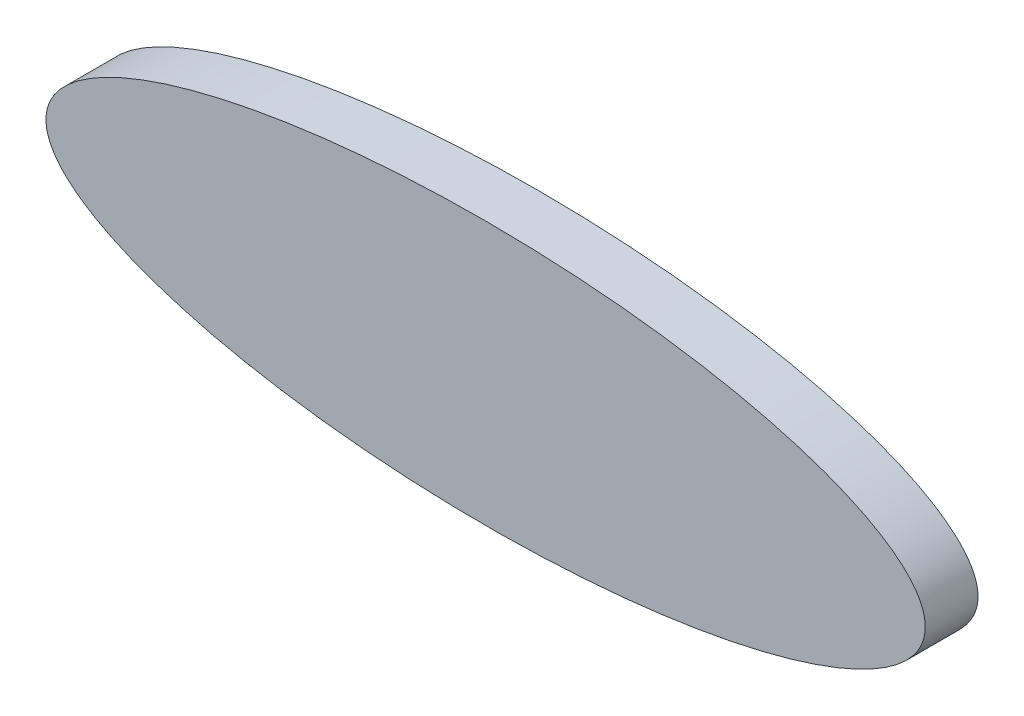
from build123d import *

# Parameters (mm, degrees)
SKETCH1_RX     = 25
SKETCH1_RY     = 7.5
EXTRUDE1_DEPTH = 3


with BuildPart() as part:
    # Sketch1 → Extrude1 (new body)
    with BuildSketch(Plane.XY):
        with Locations((0, 0)):
            Ellipse(SKETCH1_RX, SKETCH1_RY)
    extrude(amount=EXTRUDE1_DEPTH)


solid = part.part
